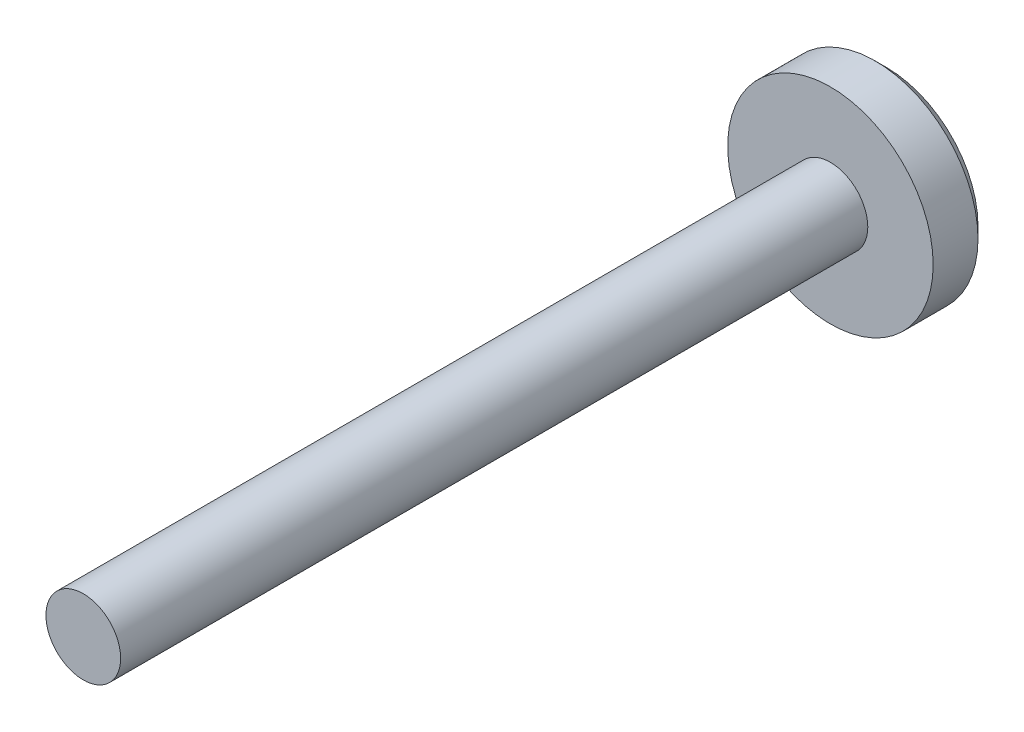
from build123d import *

# Parameters (mm, degrees)
ESQUISSE1_R          = 27.5
BASE_EXTRUSION_DEPTH = 15
ESQUISSE2_R          = 10
BOSS_EXTRU_1_DEPTH   = 200
CHANFREIN1_SIZE      = 3


with BuildPart() as part:
    # Esquisse1 → Base-Extrusion (new body)
    with BuildSketch(Plane.XY):
        Circle(ESQUISSE1_R)
    extrude(amount=BASE_EXTRUSION_DEPTH)

    # Esquisse2 → Boss.-Extru.1 (add)
    with BuildSketch(Plane.XY.offset(15)):
        Circle(ESQUISSE2_R)
    extrude(amount=BOSS_EXTRU_1_DEPTH)

    # Chanfrein1
    chanfrein1_edges = [part.edges().sort_by_distance(p)[0] for p in [
        (-27.5, 0, 0),
    ]]
    chamfer(chanfrein1_edges, length=CHANFREIN1_SIZE)


solid = part.part
